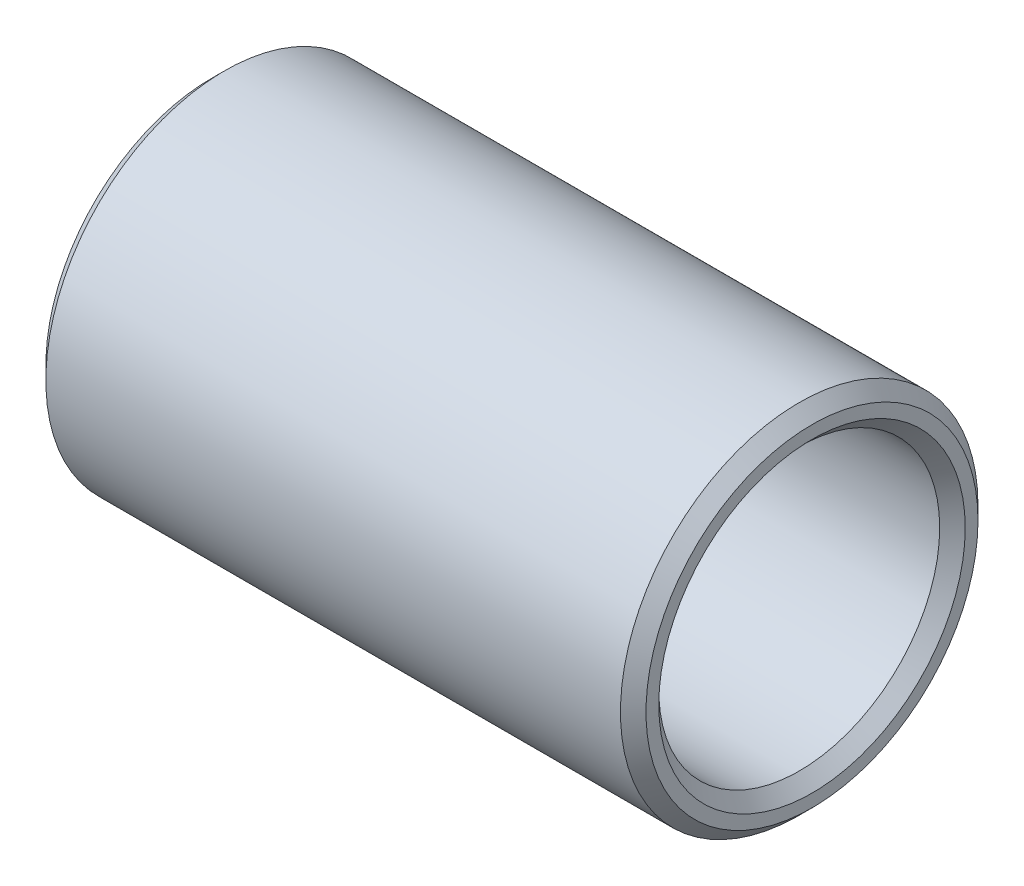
from build123d import *


with BuildPart() as part:
    # Esquisse1 → R_volution1 (revolve)
    with BuildSketch(Plane.XY, mode=Mode.PRIVATE) as r_volution1_sk:
        Polygon((0, 12), (1, 11), (46, 11), (47, 12), (47, 13), (46, 14), (1, 14), (0, 13), align=None)
    revolve(r_volution1_sk.sketch.rotate(Axis((47, 0, 0), (-1, 0, 0)), 90), axis=Axis((47, 0, 0), (-1, 0, 0)))


solid = part.part
